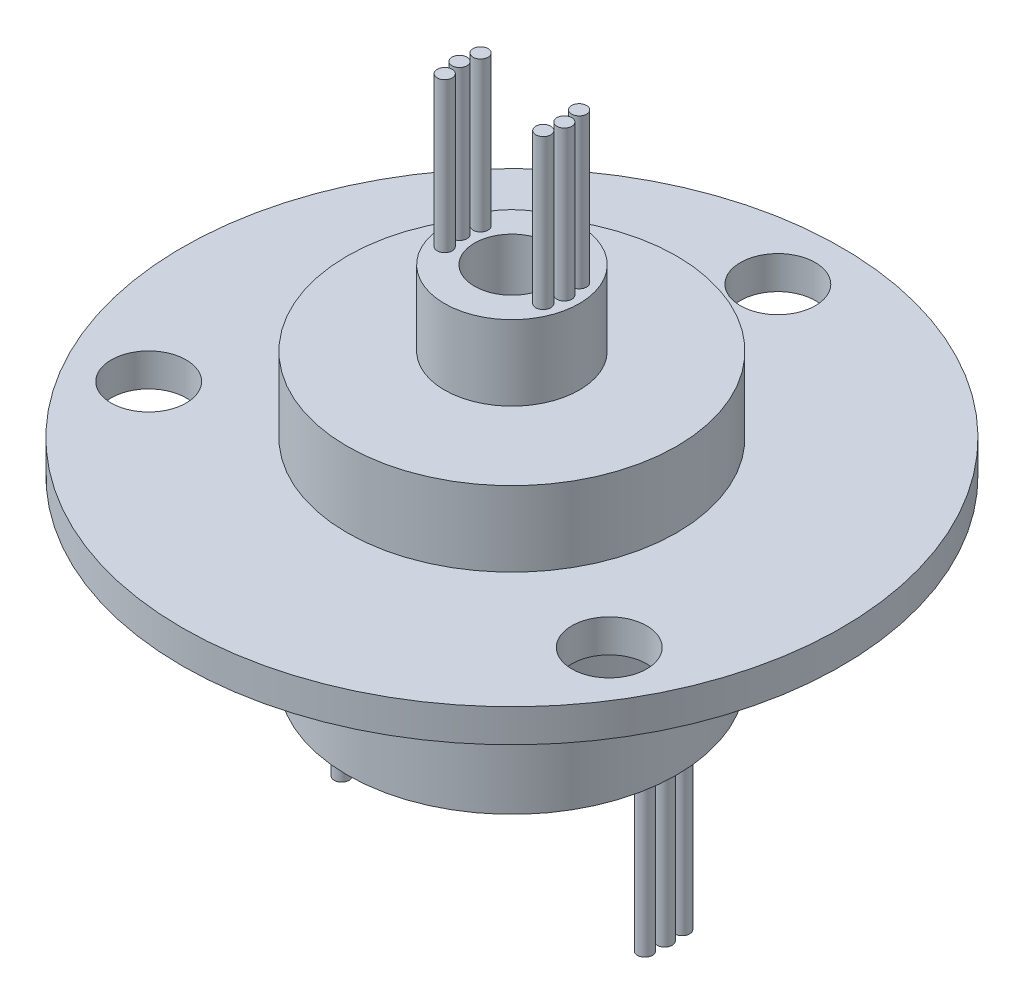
from build123d import *

# Parameters (mm, degrees)
SKETCH_1_R          = 22
SKETCH_1_R_2        = 2.5
EXTRUDE_1_DEPTH     = 2.2
SKETCH_2_R          = 11
EXTRUDE_2_DEPTH     = 5
SKETCH_3_R          = 4.5
EXTRUDE_3_DEPTH     = 5
EXTRUDE_START       = 11.8
SKETCH_4_R          = 11
EXTRUDE_4_DEPTH     = 11.8
SKETCH_5_R          = 2.5
CUT_EXTRUDE_1_DEPTH = 40.293765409
SKETCH_6_R          = 0.5
EXTRUDE_5_DEPTH     = 10
SKETCH_7_R          = 0.5
EXTRUDE_6_DEPTH     = 10


with BuildPart() as part:
    # Sketch 1 → Extrude 1 (new body)
    with BuildSketch(Plane(origin=(0, 0, 0), x_dir=(1, 0, 0), z_dir=(0, 1, 0))):
        with Locations(Location((0, 0, 0), (0, 0, 270))):
            Circle(SKETCH_1_R)
        with Locations(Location((0, 17.75, 0), (0, 0, 270))):
            Circle(SKETCH_1_R_2, mode=Mode.SUBTRACT)
        with Locations(Location((15.371950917, -8.875, 0), (0, 0, 270))):
            Circle(SKETCH_1_R_2, mode=Mode.SUBTRACT)
        with Locations(Location((-15.371950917, -8.875, 0), (0, 0, 270))):
            Circle(SKETCH_1_R_2, mode=Mode.SUBTRACT)
    extrude(amount=EXTRUDE_1_DEPTH)

    # Sketch 2 → Extrude 2 (add)
    with BuildSketch(Plane(origin=(0, 2.2, 0), x_dir=(1, 0, 0), z_dir=(0, 1, 0))):
        with Locations(Location((0, 0, 0), (0, 0, 270))):
            Circle(SKETCH_2_R)
    extrude(amount=EXTRUDE_2_DEPTH)

    # Sketch 3 → Extrude 3 (add)
    with BuildSketch(Plane(origin=(0, 7.2, 0), x_dir=(1, 0, 0), z_dir=(0, 1, 0))):
        with Locations(Location((0, 0, 0), (0, 0, 270))):
            Circle(SKETCH_3_R)
    extrude(amount=EXTRUDE_3_DEPTH)

    # Sketch 4 → Extrude 4 (add)
    with BuildSketch(Plane.XZ.offset(EXTRUDE_START)):
        with Locations(Location((0, 0, 0), (0, 0, 90))):
            Circle(SKETCH_4_R)
    extrude(amount=-EXTRUDE_4_DEPTH)

    # Sketch 5 → Cut-Extrude 1 (cut, through all)
    with BuildSketch(Plane(origin=(0, 12.2, 0), x_dir=(1, 0, 0), z_dir=(0, 1, 0))):
        with Locations(Location((0, 0, 0), (0, 0, 270))):
            Circle(SKETCH_5_R)
    extrude(amount=-CUT_EXTRUDE_1_DEPTH, mode=Mode.SUBTRACT)

    # Sketch 6 → Extrude 5 (add)
    with BuildSketch(Plane(origin=(0, 12.2, 0), x_dir=(1, 0, 0), z_dir=(0, 1, 0))):
        with Locations(Location((-3.5, 0, 0), (0, 0, 270))):
            Circle(SKETCH_6_R)
        with Locations(Location((-3.288924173, 1.197070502, 0), (0, 0, 270))):
            Circle(SKETCH_6_R)
        with Locations(Location((-3.288924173, -1.197070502, 0), (0, 0, 90))):
            Circle(SKETCH_6_R)
        with Locations(Location((3.288924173, -1.197070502, 0), (0, 0, 270))):
            Circle(SKETCH_6_R)
        with Locations(Location((3.5, 0, 0), (0, 0, 90))):
            Circle(SKETCH_6_R)
        with Locations(Location((3.288924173, 1.197070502, 0), (0, 0, 90))):
            Circle(SKETCH_6_R)
    extrude(amount=EXTRUDE_5_DEPTH)

    # Sketch 7 → Extrude 6 (add)
    with BuildSketch(Plane.XZ.offset(11.8)):
        with Locations(Location((-10.198712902, 0, 0), (0, 0, 270))):
            Circle(SKETCH_7_R)
        with Locations(Location((-10.122693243, 1.242910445, 0), (0, 0, 270))):
            Circle(SKETCH_7_R)
        with Locations(Location((-10.122693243, -1.242910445, 0), (0, 0, 90))):
            Circle(SKETCH_7_R)
        with Locations(Location((10.122693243, -1.242910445, 0), (0, 0, 270))):
            Circle(SKETCH_7_R)
        with Locations(Location((10.198712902, 0, 0), (0, 0, 90))):
            Circle(SKETCH_7_R)
        with Locations(Location((10.122693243, 1.242910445, 0), (0, 0, 90))):
            Circle(SKETCH_7_R)
    extrude(amount=EXTRUDE_6_DEPTH)


solid = part.part
